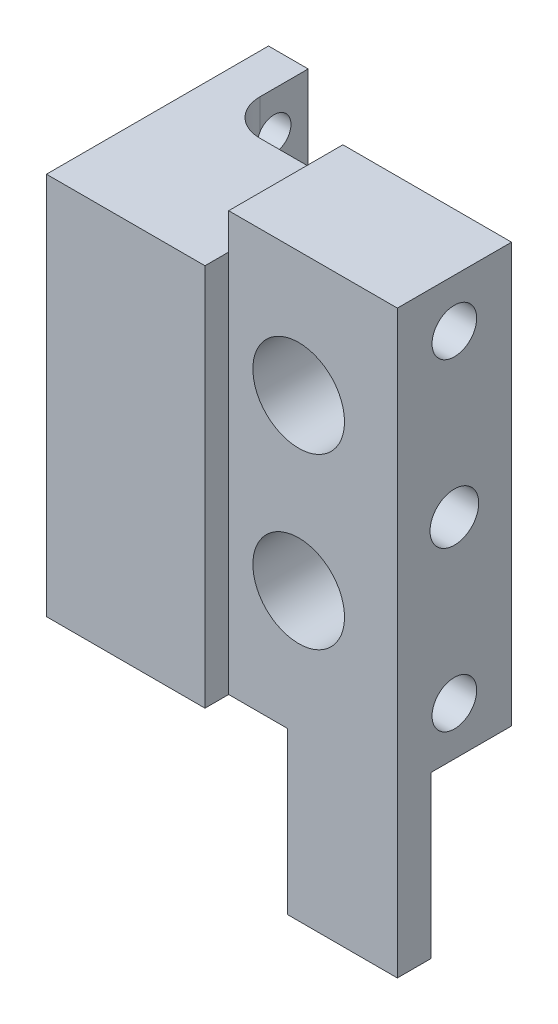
ISO-10303-21;
HEADER;
FILE_DESCRIPTION(('STEP AP214'),'2;1');
FILE_NAME('part.step','',(''),(''),'','','');
FILE_SCHEMA(('AUTOMOTIVE_DESIGN { 1 0 10303 214 1 1 1 1 }'));
ENDSEC;
DATA;
#1=APPLICATION_CONTEXT('core data for automotive mechanical design processes');
#2=APPLICATION_PROTOCOL_DEFINITION('international standard','automotive_design',2000,#1);
#3=PRODUCT_CONTEXT('',#1,'mechanical');
#4=PRODUCT('Part','Part','',(#3));
#5=PRODUCT_RELATED_PRODUCT_CATEGORY('part','',(#4));
#6=PRODUCT_DEFINITION_FORMATION('','',#4);
#7=PRODUCT_DEFINITION_CONTEXT('part definition',#1,'design');
#8=PRODUCT_DEFINITION('design','',#6,#7);
#9=PRODUCT_DEFINITION_SHAPE('','',#8);
#10=(LENGTH_UNIT() NAMED_UNIT(*) SI_UNIT(.MILLI.,.METRE.));
#11=(NAMED_UNIT(*) PLANE_ANGLE_UNIT() SI_UNIT($,.RADIAN.));
#12=(NAMED_UNIT(*) SI_UNIT($,.STERADIAN.) SOLID_ANGLE_UNIT());
#13=UNCERTAINTY_MEASURE_WITH_UNIT(LENGTH_MEASURE(1.E-05),#10,'distance_accuracy_value','');
#14=(GEOMETRIC_REPRESENTATION_CONTEXT(3) GLOBAL_UNCERTAINTY_ASSIGNED_CONTEXT((#13)) GLOBAL_UNIT_ASSIGNED_CONTEXT((#10,
#11,#12)) REPRESENTATION_CONTEXT('',''));
#15=CARTESIAN_POINT('',(0.,0.,0.));
#16=DIRECTION('',(0.,0.,1.));
#17=DIRECTION('',(1.,0.,0.));
#18=AXIS2_PLACEMENT_3D('',#15,#16,#17);
#19=CARTESIAN_POINT('',(6.9977,14.859,8.89));
#20=DIRECTION('',(-1.,0.,0.));
#21=DIRECTION('',(0.,-1.,0.));
#22=AXIS2_PLACEMENT_3D('',#19,#20,#21);
#23=PLANE('',#22);
#24=CARTESIAN_POINT('',(6.99770000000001,0.,4.05559999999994));
#25=DIRECTION('',(1.,0.,0.));
#26=DIRECTION('',(0.,0.,-1.));
#27=AXIS2_PLACEMENT_3D('',#24,#25,#26);
#28=CIRCLE('',#27,1.72719999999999);
#29=CARTESIAN_POINT('',(6.99770000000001,0.,2.32839999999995));
#30=VERTEX_POINT('',#29);
#31=EDGE_CURVE('E254',#30,#30,#28,.T.);
#32=ORIENTED_EDGE('',*,*,#31,.F.);
#33=EDGE_LOOP('',(#32));
#34=FACE_BOUND('',#33,.T.);
#35=CARTESIAN_POINT('',(6.99770000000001,-11.4299999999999,4.05559999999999));
#36=DIRECTION('',(1.,0.,0.));
#37=DIRECTION('',(0.,0.,-1.));
#38=AXIS2_PLACEMENT_3D('',#35,#36,#37);
#39=CIRCLE('',#38,1.58369);
#40=CARTESIAN_POINT('',(6.99770000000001,-11.4299999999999,2.47190999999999));
#41=VERTEX_POINT('',#40);
#42=EDGE_CURVE('E248',#41,#41,#39,.T.);
#43=ORIENTED_EDGE('',*,*,#42,.F.);
#44=EDGE_LOOP('',(#43));
#45=FACE_BOUND('',#44,.T.);
#46=CARTESIAN_POINT('',(6.9977,11.4300000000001,4.0556));
#47=DIRECTION('',(1.,0.,0.));
#48=DIRECTION('',(0.,0.,-1.));
#49=AXIS2_PLACEMENT_3D('',#46,#47,#48);
#50=CIRCLE('',#49,1.58369);
#51=CARTESIAN_POINT('',(6.9977,11.4300000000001,2.47191));
#52=VERTEX_POINT('',#51);
#53=EDGE_CURVE('E242',#52,#52,#50,.T.);
#54=ORIENTED_EDGE('',*,*,#53,.F.);
#55=EDGE_LOOP('',(#54));
#56=FACE_BOUND('',#55,.T.);
#57=DIRECTION('',(0.,0.,-1.));
#58=VECTOR('',#57,1.);
#59=CARTESIAN_POINT('',(6.9977,14.859,8.89));
#60=LINE('',#59,#58);
#61=CARTESIAN_POINT('',(6.99770000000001,14.859,8.099425));
#62=VERTEX_POINT('',#61);
#63=CARTESIAN_POINT('',(6.9977,14.859,0.));
#64=VERTEX_POINT('',#63);
#65=EDGE_CURVE('E298',#62,#64,#60,.T.);
#66=ORIENTED_EDGE('',*,*,#65,.F.);
#67=DIRECTION('',(0.,1.,0.));
#68=VECTOR('',#67,1.);
#69=CARTESIAN_POINT('',(6.9977,-14.859,8.099425));
#70=LINE('',#69,#68);
#71=CARTESIAN_POINT('',(6.9977,-26.289,8.099425));
#72=VERTEX_POINT('',#71);
#73=EDGE_CURVE('E314',#72,#62,#70,.T.);
#74=ORIENTED_EDGE('',*,*,#73,.F.);
#75=DIRECTION('',(0.,0.,-1.));
#76=VECTOR('',#75,1.);
#77=CARTESIAN_POINT('',(6.9977,-26.289,8.099425));
#78=LINE('',#77,#76);
#79=CARTESIAN_POINT('',(6.9977,-26.289,5.718175));
#80=VERTEX_POINT('',#79);
#81=EDGE_CURVE('E326',#72,#80,#78,.T.);
#82=ORIENTED_EDGE('',*,*,#81,.T.);
#83=DIRECTION('',(0.,1.,0.));
#84=VECTOR('',#83,1.);
#85=CARTESIAN_POINT('',(6.9977,-14.859,5.718175));
#86=LINE('',#85,#84);
#87=CARTESIAN_POINT('',(6.99770000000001,-14.859,5.718175));
#88=VERTEX_POINT('',#87);
#89=EDGE_CURVE('E266',#80,#88,#86,.T.);
#90=ORIENTED_EDGE('',*,*,#89,.T.);
#91=DIRECTION('',(0.,0.,-1.));
#92=VECTOR('',#91,1.);
#93=CARTESIAN_POINT('',(6.99770000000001,-14.859,8.89));
#94=LINE('',#93,#92);
#95=CARTESIAN_POINT('',(6.99770000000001,-14.859,0.));
#96=VERTEX_POINT('',#95);
#97=EDGE_CURVE('E311',#88,#96,#94,.T.);
#98=ORIENTED_EDGE('',*,*,#97,.T.);
#99=DIRECTION('',(0.,1.,0.));
#100=VECTOR('',#99,1.);
#101=CARTESIAN_POINT('',(6.9977,14.859,0.));
#102=LINE('',#101,#100);
#103=EDGE_CURVE('E286',#96,#64,#102,.T.);
#104=ORIENTED_EDGE('',*,*,#103,.T.);
#105=EDGE_LOOP('',(#66,#74,#82,#90,#98,#104));
#106=FACE_BOUND('',#105,.T.);
#107=ADVANCED_FACE('F33',(#34,#45,#56,#106),#23,.F.);
#108=CARTESIAN_POINT('',(-6.9977,14.859,8.89));
#109=DIRECTION('',(0.,-1.,0.));
#110=DIRECTION('',(0.,0.,-1.));
#111=AXIS2_PLACEMENT_3D('',#108,#109,#110);
#112=PLANE('',#111);
#113=DIRECTION('',(1.,0.,0.));
#114=VECTOR('',#113,1.);
#115=CARTESIAN_POINT('',(-4.9657,14.859,8.099425));
#116=LINE('',#115,#114);
#117=CARTESIAN_POINT('',(-4.9657,14.859,8.099425));
#118=VERTEX_POINT('',#117);
#119=EDGE_CURVE('E48',#118,#62,#116,.T.);
#120=ORIENTED_EDGE('',*,*,#119,.T.);
#121=ORIENTED_EDGE('',*,*,#65,.T.);
#122=DIRECTION('',(-1.,0.,0.));
#123=VECTOR('',#122,1.);
#124=CARTESIAN_POINT('',(-6.9977,14.859,0.));
#125=LINE('',#124,#123);
#126=CARTESIAN_POINT('',(-4.9657,14.859,0.));
#127=VERTEX_POINT('',#126);
#128=EDGE_CURVE('E295',#64,#127,#125,.T.);
#129=ORIENTED_EDGE('',*,*,#128,.T.);
#130=DIRECTION('',(0.,0.,-1.));
#131=VECTOR('',#130,1.);
#132=CARTESIAN_POINT('',(-4.9657,14.859,-5.969));
#133=LINE('',#132,#131);
#134=EDGE_CURVE('E201',#118,#127,#133,.T.);
#135=ORIENTED_EDGE('',*,*,#134,.F.);
#136=EDGE_LOOP('',(#120,#121,#129,#135));
#137=FACE_BOUND('',#136,.T.);
#138=ADVANCED_FACE('F382',(#137),#112,.F.);
#139=CARTESIAN_POINT('',(0.,-6.00000000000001,8.89));
#140=DIRECTION('',(0.,0.,1.));
#141=DIRECTION('',(1.,0.,0.));
#142=AXIS2_PLACEMENT_3D('',#139,#140,#141);
#143=CYLINDRICAL_SURFACE('',#142,3.25);
#144=CARTESIAN_POINT('',(0.,-6.00000000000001,2.89));
#145=DIRECTION('',(0.,0.,1.));
#146=DIRECTION('',(1.,0.,0.));
#147=AXIS2_PLACEMENT_3D('',#144,#145,#146);
#148=CIRCLE('',#147,3.25);
#149=CARTESIAN_POINT('',(3.25,-6.00000000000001,2.89));
#150=VERTEX_POINT('',#149);
#151=EDGE_CURVE('E357',#150,#150,#148,.T.);
#152=ORIENTED_EDGE('',*,*,#151,.F.);
#153=EDGE_LOOP('',(#152));
#154=FACE_BOUND('',#153,.T.);
#155=CARTESIAN_POINT('',(0.,-6.00000000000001,8.099425));
#156=DIRECTION('',(0.,0.,1.));
#157=DIRECTION('',(1.,0.,0.));
#158=AXIS2_PLACEMENT_3D('',#155,#156,#157);
#159=CIRCLE('',#158,3.25);
#160=CARTESIAN_POINT('',(3.25,-6.00000000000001,8.099425));
#161=VERTEX_POINT('',#160);
#162=EDGE_CURVE('E175',#161,#161,#159,.F.);
#163=ORIENTED_EDGE('',*,*,#162,.F.);
#164=EDGE_LOOP('',(#163));
#165=FACE_BOUND('',#164,.T.);
#166=ADVANCED_FACE('F388',(#154,#165),#143,.F.);
#167=CARTESIAN_POINT('',(0.,6.00000000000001,8.89));
#168=DIRECTION('',(0.,0.,1.));
#169=DIRECTION('',(1.,0.,0.));
#170=AXIS2_PLACEMENT_3D('',#167,#168,#169);
#171=CYLINDRICAL_SURFACE('',#170,3.25);
#172=CARTESIAN_POINT('',(0.,6.00000000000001,2.89));
#173=DIRECTION('',(0.,0.,1.));
#174=DIRECTION('',(1.,0.,0.));
#175=AXIS2_PLACEMENT_3D('',#172,#173,#174);
#176=CIRCLE('',#175,3.25);
#177=CARTESIAN_POINT('',(3.25,6.00000000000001,2.89));
#178=VERTEX_POINT('',#177);
#179=EDGE_CURVE('E348',#178,#178,#176,.T.);
#180=ORIENTED_EDGE('',*,*,#179,.F.);
#181=EDGE_LOOP('',(#180));
#182=FACE_BOUND('',#181,.T.);
#183=CARTESIAN_POINT('',(0.,6.00000000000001,8.099425));
#184=DIRECTION('',(0.,0.,1.));
#185=DIRECTION('',(1.,0.,0.));
#186=AXIS2_PLACEMENT_3D('',#183,#184,#185);
#187=CIRCLE('',#186,3.25);
#188=CARTESIAN_POINT('',(3.25,6.00000000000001,8.099425));
#189=VERTEX_POINT('',#188);
#190=EDGE_CURVE('E172',#189,#189,#187,.F.);
#191=ORIENTED_EDGE('',*,*,#190,.F.);
#192=EDGE_LOOP('',(#191));
#193=FACE_BOUND('',#192,.T.);
#194=ADVANCED_FACE('F408',(#182,#193),#171,.F.);
#195=CARTESIAN_POINT('',(-4.9657,-6.31495190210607,-5.969));
#196=DIRECTION('',(1.,0.,0.));
#197=DIRECTION('',(0.,0.,-1.));
#198=AXIS2_PLACEMENT_3D('',#195,#196,#197);
#199=PLANE('',#198);
#200=DIRECTION('',(0.,-1.,0.));
#201=VECTOR('',#200,1.);
#202=CARTESIAN_POINT('',(-4.9657,-6.31495190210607,8.099425));
#203=LINE('',#202,#201);
#204=CARTESIAN_POINT('',(-4.9657,12.319,8.099425));
#205=VERTEX_POINT('',#204);
#206=EDGE_CURVE('E11',#118,#205,#203,.T.);
#207=ORIENTED_EDGE('',*,*,#206,.F.);
#208=ORIENTED_EDGE('',*,*,#134,.T.);
#209=DIRECTION('',(0.,1.,0.));
#210=VECTOR('',#209,1.);
#211=CARTESIAN_POINT('',(-4.9657,-14.859,0.));
#212=LINE('',#211,#210);
#213=CARTESIAN_POINT('',(-4.9657,12.319,0.));
#214=VERTEX_POINT('',#213);
#215=EDGE_CURVE('E212',#214,#127,#212,.T.);
#216=ORIENTED_EDGE('',*,*,#215,.F.);
#217=DIRECTION('',(0.,0.,1.));
#218=VECTOR('',#217,1.);
#219=CARTESIAN_POINT('',(-4.9657,12.319,-5.969));
#220=LINE('',#219,#218);
#221=EDGE_CURVE('E202',#214,#205,#220,.T.);
#222=ORIENTED_EDGE('',*,*,#221,.T.);
#223=EDGE_LOOP('',(#207,#208,#216,#222));
#224=FACE_BOUND('',#223,.T.);
#225=ADVANCED_FACE('F402',(#224),#199,.F.);
#226=CARTESIAN_POINT('',(-16.21,0.793676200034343,4.62700000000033));
#227=DIRECTION('',(-1.,0.,0.));
#228=DIRECTION('',(0.,0.,-1.));
#229=AXIS2_PLACEMENT_3D('',#226,#227,#228);
#230=PLANE('',#229);
#231=CARTESIAN_POINT('',(-16.21,4.57199999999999,-3.55600000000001));
#232=DIRECTION('',(-1.,0.,0.));
#233=DIRECTION('',(0.,0.,1.));
#234=AXIS2_PLACEMENT_3D('',#231,#232,#233);
#235=CIRCLE('',#234,1.025);
#236=CARTESIAN_POINT('',(-16.21,4.57199999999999,-2.53100000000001));
#237=VERTEX_POINT('',#236);
#238=EDGE_CURVE('E215',#237,#237,#235,.T.);
#239=ORIENTED_EDGE('',*,*,#238,.F.);
#240=EDGE_LOOP('',(#239));
#241=FACE_BOUND('',#240,.T.);
#242=CARTESIAN_POINT('',(-16.21,4.57199999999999,7.36599999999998));
#243=DIRECTION('',(-1.,0.,0.));
#244=DIRECTION('',(0.,0.,1.));
#245=AXIS2_PLACEMENT_3D('',#242,#243,#244);
#246=CIRCLE('',#245,1.025);
#247=CARTESIAN_POINT('',(-16.21,4.57199999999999,8.39099999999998));
#248=VERTEX_POINT('',#247);
#249=EDGE_CURVE('E224',#248,#248,#246,.T.);
#250=ORIENTED_EDGE('',*,*,#249,.F.);
#251=EDGE_LOOP('',(#250));
#252=FACE_BOUND('',#251,.T.);
#253=CARTESIAN_POINT('',(-16.21,-8.25499999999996,7.3660000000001));
#254=DIRECTION('',(-1.,0.,0.));
#255=DIRECTION('',(0.,0.,1.));
#256=AXIS2_PLACEMENT_3D('',#253,#254,#255);
#257=CIRCLE('',#256,1.025);
#258=CARTESIAN_POINT('',(-16.21,-8.25499999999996,8.3910000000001));
#259=VERTEX_POINT('',#258);
#260=EDGE_CURVE('E230',#259,#259,#257,.T.);
#261=ORIENTED_EDGE('',*,*,#260,.F.);
#262=EDGE_LOOP('',(#261));
#263=FACE_BOUND('',#262,.T.);
#264=CARTESIAN_POINT('',(-16.21,-8.25499999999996,-3.5559999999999));
#265=DIRECTION('',(-1.,0.,0.));
#266=DIRECTION('',(0.,0.,1.));
#267=AXIS2_PLACEMENT_3D('',#264,#265,#266);
#268=CIRCLE('',#267,1.025);
#269=CARTESIAN_POINT('',(-16.21,-8.25499999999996,-2.5309999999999));
#270=VERTEX_POINT('',#269);
#271=EDGE_CURVE('E233',#270,#270,#268,.T.);
#272=ORIENTED_EDGE('',*,*,#271,.F.);
#273=EDGE_LOOP('',(#272));
#274=FACE_BOUND('',#273,.T.);
#275=CARTESIAN_POINT('',(-16.21,9.52500000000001,7.36599999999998));
#276=DIRECTION('',(-1.,0.,0.));
#277=DIRECTION('',(0.,0.,1.));
#278=AXIS2_PLACEMENT_3D('',#275,#276,#277);
#279=CIRCLE('',#278,1.19062499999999);
#280=CARTESIAN_POINT('',(-16.21,9.52500000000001,8.55662499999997));
#281=VERTEX_POINT('',#280);
#282=EDGE_CURVE('E198',#281,#281,#279,.T.);
#283=ORIENTED_EDGE('',*,*,#282,.F.);
#284=EDGE_LOOP('',(#283));
#285=FACE_BOUND('',#284,.T.);
#286=CARTESIAN_POINT('',(-16.21,9.52500000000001,-3.55600000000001));
#287=DIRECTION('',(-1.,0.,0.));
#288=DIRECTION('',(0.,0.,1.));
#289=AXIS2_PLACEMENT_3D('',#286,#287,#288);
#290=CIRCLE('',#289,1.19062499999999);
#291=CARTESIAN_POINT('',(-16.21,9.52500000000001,-2.36537500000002));
#292=VERTEX_POINT('',#291);
#293=EDGE_CURVE('E189',#292,#292,#290,.T.);
#294=ORIENTED_EDGE('',*,*,#293,.F.);
#295=EDGE_LOOP('',(#294));
#296=FACE_BOUND('',#295,.T.);
#297=DIRECTION('',(0.,0.,1.));
#298=VECTOR('',#297,1.);
#299=CARTESIAN_POINT('',(-16.21,-14.859,0.));
#300=LINE('',#299,#298);
#301=CARTESIAN_POINT('',(-16.2100000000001,-14.859,-5.969));
#302=VERTEX_POINT('',#301);
#303=CARTESIAN_POINT('',(-16.2100000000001,-14.859,9.77900000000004));
#304=VERTEX_POINT('',#303);
#305=EDGE_CURVE('E307',#302,#304,#300,.T.);
#306=ORIENTED_EDGE('',*,*,#305,.T.);
#307=DIRECTION('',(0.,1.,0.));
#308=VECTOR('',#307,1.);
#309=CARTESIAN_POINT('',(-16.2100000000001,12.319,9.77900000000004));
#310=LINE('',#309,#308);
#311=CARTESIAN_POINT('',(-16.2100000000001,12.319,9.77900000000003));
#312=VERTEX_POINT('',#311);
#313=EDGE_CURVE('E181',#304,#312,#310,.T.);
#314=ORIENTED_EDGE('',*,*,#313,.T.);
#315=DIRECTION('',(0.,0.,1.));
#316=VECTOR('',#315,1.);
#317=CARTESIAN_POINT('',(-16.21,12.319,13.716));
#318=LINE('',#317,#316);
#319=CARTESIAN_POINT('',(-16.2100000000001,12.319,-5.969));
#320=VERTEX_POINT('',#319);
#321=EDGE_CURVE('E159',#320,#312,#318,.T.);
#322=ORIENTED_EDGE('',*,*,#321,.F.);
#323=DIRECTION('',(0.,1.,0.));
#324=VECTOR('',#323,1.);
#325=CARTESIAN_POINT('',(-16.2100000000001,14.859,-5.969));
#326=LINE('',#325,#324);
#327=EDGE_CURVE('E339',#302,#320,#326,.T.);
#328=ORIENTED_EDGE('',*,*,#327,.F.);
#329=EDGE_LOOP('',(#306,#314,#322,#328));
#330=FACE_BOUND('',#329,.T.);
#331=ADVANCED_FACE('F395',(#241,#252,#263,#274,#285,#296,#330),#230,.T.);
#332=CARTESIAN_POINT('',(-6.9977,-14.859,8.89));
#333=DIRECTION('',(0.,1.,0.));
#334=DIRECTION('',(0.,0.,1.));
#335=AXIS2_PLACEMENT_3D('',#332,#333,#334);
#336=PLANE('',#335);
#337=DIRECTION('',(-1.,0.,0.));
#338=VECTOR('',#337,1.);
#339=CARTESIAN_POINT('',(-4.9657,-14.859,8.099425));
#340=LINE('',#339,#338);
#341=CARTESIAN_POINT('',(-0.783589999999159,-14.859,8.099425));
#342=VERTEX_POINT('',#341);
#343=CARTESIAN_POINT('',(-4.9657,-14.859,8.099425));
#344=VERTEX_POINT('',#343);
#345=EDGE_CURVE('E165',#342,#344,#340,.T.);
#346=ORIENTED_EDGE('',*,*,#345,.T.);
#347=DIRECTION('',(0.,0.,-1.));
#348=VECTOR('',#347,1.);
#349=CARTESIAN_POINT('',(-4.9657,-14.859,8.099425));
#350=LINE('',#349,#348);
#351=CARTESIAN_POINT('',(-4.9657,-14.859,9.77900000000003));
#352=VERTEX_POINT('',#351);
#353=EDGE_CURVE('E150',#352,#344,#350,.T.);
#354=ORIENTED_EDGE('',*,*,#353,.F.);
#355=DIRECTION('',(-1.,0.,0.));
#356=VECTOR('',#355,1.);
#357=CARTESIAN_POINT('',(-4.96569999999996,-14.859,9.77900000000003));
#358=LINE('',#357,#356);
#359=EDGE_CURVE('E56',#352,#304,#358,.T.);
#360=ORIENTED_EDGE('',*,*,#359,.T.);
#361=ORIENTED_EDGE('',*,*,#305,.F.);
#362=DIRECTION('',(-1.,0.,0.));
#363=VECTOR('',#362,1.);
#364=CARTESIAN_POINT('',(-16.2100000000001,-14.859,-5.969));
#365=LINE('',#364,#363);
#366=CARTESIAN_POINT('',(-13.3946899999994,-14.859,-5.969));
#367=VERTEX_POINT('',#366);
#368=EDGE_CURVE('E308',#367,#302,#365,.T.);
#369=ORIENTED_EDGE('',*,*,#368,.F.);
#370=DIRECTION('',(0.,0.,1.));
#371=VECTOR('',#370,1.);
#372=CARTESIAN_POINT('',(-13.3946899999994,-14.859,-5.969));
#373=LINE('',#372,#371);
#374=CARTESIAN_POINT('',(-13.3946899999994,-14.859,-2.54));
#375=VERTEX_POINT('',#374);
#376=EDGE_CURVE('E304',#367,#375,#373,.T.);
#377=ORIENTED_EDGE('',*,*,#376,.T.);
#378=CARTESIAN_POINT('',(-10.8546899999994,-14.859,-2.54));
#379=DIRECTION('',(0.,1.,0.));
#380=DIRECTION('',(0.,0.,1.));
#381=AXIS2_PLACEMENT_3D('',#378,#379,#380);
#382=CIRCLE('',#381,2.54);
#383=CARTESIAN_POINT('',(-10.8546899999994,-14.859,0.));
#384=VERTEX_POINT('',#383);
#385=EDGE_CURVE('E806',#375,#384,#382,.T.);
#386=ORIENTED_EDGE('',*,*,#385,.T.);
#387=DIRECTION('',(1.,0.,0.));
#388=VECTOR('',#387,1.);
#389=CARTESIAN_POINT('',(-6.99770000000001,-14.859,0.));
#390=LINE('',#389,#388);
#391=EDGE_CURVE('E283',#384,#96,#390,.T.);
#392=ORIENTED_EDGE('',*,*,#391,.T.);
#393=ORIENTED_EDGE('',*,*,#97,.F.);
#394=DIRECTION('',(-1.,0.,0.));
#395=VECTOR('',#394,1.);
#396=CARTESIAN_POINT('',(-0.78358999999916,-14.859,5.718175));
#397=LINE('',#396,#395);
#398=CARTESIAN_POINT('',(-0.78358999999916,-14.859,5.718175));
#399=VERTEX_POINT('',#398);
#400=EDGE_CURVE('E272',#88,#399,#397,.T.);
#401=ORIENTED_EDGE('',*,*,#400,.T.);
#402=DIRECTION('',(0.,0.,-1.));
#403=VECTOR('',#402,1.);
#404=CARTESIAN_POINT('',(-0.78358999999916,-14.859,8.099425));
#405=LINE('',#404,#403);
#406=EDGE_CURVE('E170',#342,#399,#405,.T.);
#407=ORIENTED_EDGE('',*,*,#406,.F.);
#408=EDGE_LOOP('',(#346,#354,#360,#361,#369,#377,#386,#392,#393,#401,#407));
#409=FACE_BOUND('',#408,.T.);
#410=ADVANCED_FACE('F168',(#409),#336,.F.);
#411=CARTESIAN_POINT('',(-6.99770000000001,12.319,8.89));
#412=DIRECTION('',(0.,1.,0.));
#413=DIRECTION('',(0.,0.,1.));
#414=AXIS2_PLACEMENT_3D('',#411,#412,#413);
#415=PLANE('',#414);
#416=ORIENTED_EDGE('',*,*,#321,.T.);
#417=DIRECTION('',(1.,0.,0.));
#418=VECTOR('',#417,1.);
#419=CARTESIAN_POINT('',(-4.96569999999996,12.319,9.77900000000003));
#420=LINE('',#419,#418);
#421=CARTESIAN_POINT('',(-4.9657,12.319,9.77900000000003));
#422=VERTEX_POINT('',#421);
#423=EDGE_CURVE('E186',#312,#422,#420,.T.);
#424=ORIENTED_EDGE('',*,*,#423,.T.);
#425=DIRECTION('',(0.,0.,1.));
#426=VECTOR('',#425,1.);
#427=CARTESIAN_POINT('',(-4.9657,12.319,8.099425));
#428=LINE('',#427,#426);
#429=EDGE_CURVE('E160',#205,#422,#428,.T.);
#430=ORIENTED_EDGE('',*,*,#429,.F.);
#431=ORIENTED_EDGE('',*,*,#221,.F.);
#432=DIRECTION('',(-1.,0.,0.));
#433=VECTOR('',#432,1.);
#434=CARTESIAN_POINT('',(-6.9977,12.319,0.));
#435=LINE('',#434,#433);
#436=CARTESIAN_POINT('',(-10.8546899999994,12.319,0.));
#437=VERTEX_POINT('',#436);
#438=EDGE_CURVE('E210',#214,#437,#435,.T.);
#439=ORIENTED_EDGE('',*,*,#438,.T.);
#440=CARTESIAN_POINT('',(-10.8546899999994,12.319,-2.54));
#441=DIRECTION('',(0.,1.,0.));
#442=DIRECTION('',(0.,0.,1.));
#443=AXIS2_PLACEMENT_3D('',#440,#441,#442);
#444=CIRCLE('',#443,2.54);
#445=CARTESIAN_POINT('',(-13.3946899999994,12.319,-2.54));
#446=VERTEX_POINT('',#445);
#447=EDGE_CURVE('E486',#437,#446,#444,.F.);
#448=ORIENTED_EDGE('',*,*,#447,.T.);
#449=DIRECTION('',(0.,0.,-1.));
#450=VECTOR('',#449,1.);
#451=CARTESIAN_POINT('',(-13.3946899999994,12.319,-5.969));
#452=LINE('',#451,#450);
#453=CARTESIAN_POINT('',(-13.3946899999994,12.319,-5.969));
#454=VERTEX_POINT('',#453);
#455=EDGE_CURVE('E207',#446,#454,#452,.T.);
#456=ORIENTED_EDGE('',*,*,#455,.T.);
#457=DIRECTION('',(1.,0.,0.));
#458=VECTOR('',#457,1.);
#459=CARTESIAN_POINT('',(-16.2100000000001,12.319,-5.969));
#460=LINE('',#459,#458);
#461=EDGE_CURVE('E204',#320,#454,#460,.T.);
#462=ORIENTED_EDGE('',*,*,#461,.F.);
#463=EDGE_LOOP('',(#416,#424,#430,#431,#439,#448,#456,#462));
#464=FACE_BOUND('',#463,.T.);
#465=ADVANCED_FACE('F394',(#464),#415,.T.);
#466=CARTESIAN_POINT('',(-4.9657,12.319,8.099425));
#467=DIRECTION('',(1.,0.,0.));
#468=DIRECTION('',(0.,0.,-1.));
#469=AXIS2_PLACEMENT_3D('',#466,#467,#468);
#470=PLANE('',#469);
#471=ORIENTED_EDGE('',*,*,#429,.T.);
#472=DIRECTION('',(0.,-1.,0.));
#473=VECTOR('',#472,1.);
#474=CARTESIAN_POINT('',(-4.9657,12.319,9.77900000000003));
#475=LINE('',#474,#473);
#476=EDGE_CURVE('E156',#422,#352,#475,.T.);
#477=ORIENTED_EDGE('',*,*,#476,.T.);
#478=ORIENTED_EDGE('',*,*,#353,.T.);
#479=DIRECTION('',(0.,1.,0.));
#480=VECTOR('',#479,1.);
#481=CARTESIAN_POINT('',(-4.9657,14.859,8.099425));
#482=LINE('',#481,#480);
#483=EDGE_CURVE('E154',#344,#205,#482,.T.);
#484=ORIENTED_EDGE('',*,*,#483,.T.);
#485=EDGE_LOOP('',(#471,#477,#478,#484));
#486=FACE_BOUND('',#485,.T.);
#487=ADVANCED_FACE('F153',(#486),#470,.T.);
#488=CARTESIAN_POINT('',(-13.3946899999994,14.859,-5.969));
#489=DIRECTION('',(-1.,0.,0.));
#490=DIRECTION('',(0.,-1.,0.));
#491=AXIS2_PLACEMENT_3D('',#488,#489,#490);
#492=PLANE('',#491);
#493=DIRECTION('',(0.,-1.,0.));
#494=VECTOR('',#493,1.);
#495=CARTESIAN_POINT('',(-13.3946899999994,-14.859,-2.54));
#496=LINE('',#495,#494);
#497=CARTESIAN_POINT('',(-13.3946899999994,10.1457510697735,-2.54));
#498=VERTEX_POINT('',#497);
#499=EDGE_CURVE('E277',#446,#498,#496,.T.);
#500=ORIENTED_EDGE('',*,*,#499,.T.);
#501=CARTESIAN_POINT('',(-13.3946899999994,9.52500000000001,-3.55600000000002));
#502=DIRECTION('',(-1.,0.,0.));
#503=DIRECTION('',(0.,-1.,0.));
#504=AXIS2_PLACEMENT_3D('',#501,#502,#503);
#505=CIRCLE('',#504,1.19062499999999);
#506=CARTESIAN_POINT('',(-13.3946899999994,8.90424893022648,-2.54));
#507=VERTEX_POINT('',#506);
#508=EDGE_CURVE('E192',#498,#507,#505,.T.);
#509=ORIENTED_EDGE('',*,*,#508,.T.);
#510=CARTESIAN_POINT('',(-13.3946899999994,4.7075322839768,-2.54));
#511=VERTEX_POINT('',#510);
#512=EDGE_CURVE('E281',#507,#511,#496,.T.);
#513=ORIENTED_EDGE('',*,*,#512,.T.);
#514=CARTESIAN_POINT('',(-13.3946899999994,4.57199999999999,-3.55600000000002));
#515=DIRECTION('',(-1.,0.,0.));
#516=DIRECTION('',(0.,-1.,0.));
#517=AXIS2_PLACEMENT_3D('',#514,#515,#516);
#518=CIRCLE('',#517,1.025);
#519=CARTESIAN_POINT('',(-13.3946899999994,4.43646771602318,-2.54));
#520=VERTEX_POINT('',#519);
#521=EDGE_CURVE('E218',#511,#520,#518,.T.);
#522=ORIENTED_EDGE('',*,*,#521,.T.);
#523=CARTESIAN_POINT('',(-13.3946899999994,-8.11946771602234,-2.54));
#524=VERTEX_POINT('',#523);
#525=EDGE_CURVE('E802',#520,#524,#496,.T.);
#526=ORIENTED_EDGE('',*,*,#525,.T.);
#527=CARTESIAN_POINT('',(-13.3946899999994,-8.25499999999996,-3.55599999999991));
#528=DIRECTION('',(-1.,0.,0.));
#529=DIRECTION('',(0.,-1.,0.));
#530=AXIS2_PLACEMENT_3D('',#527,#528,#529);
#531=CIRCLE('',#530,1.025);
#532=CARTESIAN_POINT('',(-13.3946899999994,-8.39053228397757,-2.54));
#533=VERTEX_POINT('',#532);
#534=EDGE_CURVE('E236',#524,#533,#531,.T.);
#535=ORIENTED_EDGE('',*,*,#534,.T.);
#536=EDGE_CURVE('E282',#533,#375,#496,.T.);
#537=ORIENTED_EDGE('',*,*,#536,.T.);
#538=ORIENTED_EDGE('',*,*,#376,.F.);
#539=DIRECTION('',(0.,-1.,0.));
#540=VECTOR('',#539,1.);
#541=CARTESIAN_POINT('',(-13.3946899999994,14.859,-5.969));
#542=LINE('',#541,#540);
#543=EDGE_CURVE('E342',#454,#367,#542,.T.);
#544=ORIENTED_EDGE('',*,*,#543,.F.);
#545=ORIENTED_EDGE('',*,*,#455,.F.);
#546=EDGE_LOOP('',(#500,#509,#513,#522,#526,#535,#537,#538,#544,#545));
#547=FACE_BOUND('',#546,.T.);
#548=ADVANCED_FACE('F415',(#547),#492,.F.);
#549=CARTESIAN_POINT('',(-16.2100000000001,-14.859,-5.969));
#550=DIRECTION('',(0.,0.,1.));
#551=DIRECTION('',(1.,0.,0.));
#552=AXIS2_PLACEMENT_3D('',#549,#550,#551);
#553=PLANE('',#552);
#554=ORIENTED_EDGE('',*,*,#461,.T.);
#555=ORIENTED_EDGE('',*,*,#543,.T.);
#556=ORIENTED_EDGE('',*,*,#368,.T.);
#557=ORIENTED_EDGE('',*,*,#327,.T.);
#558=EDGE_LOOP('',(#554,#555,#556,#557));
#559=FACE_BOUND('',#558,.T.);
#560=ADVANCED_FACE('F448',(#559),#553,.F.);
#561=CARTESIAN_POINT('',(-10.8546899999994,14.859,-2.54));
#562=DIRECTION('',(0.,1.,0.));
#563=DIRECTION('',(-1.,0.,0.));
#564=AXIS2_PLACEMENT_3D('',#561,#562,#563);
#565=CYLINDRICAL_SURFACE('',#564,2.54);
#566=ORIENTED_EDGE('',*,*,#512,.F.);
#567=CARTESIAN_POINT('',(-13.3946899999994,8.90424893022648,-2.54));
#568=CARTESIAN_POINT('',(-13.3946881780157,8.93282424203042,-2.5225414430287));
#569=CARTESIAN_POINT('',(-13.3945103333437,8.96212169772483,-2.50629771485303));
#570=CARTESIAN_POINT('',(-13.3939364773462,9.02197600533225,-2.47633527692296));
#571=CARTESIAN_POINT('',(-13.3935404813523,9.05253276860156,-2.46261638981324));
#572=CARTESIAN_POINT('',(-13.3922276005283,9.14570765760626,-2.42543177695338));
#573=CARTESIAN_POINT('',(-13.3911848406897,9.20993579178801,-2.40587384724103));
#574=CARTESIAN_POINT('',(-13.3895458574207,9.34076008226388,-2.37781196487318));
#575=CARTESIAN_POINT('',(-13.3889497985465,9.40735710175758,-2.36931208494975));
#576=CARTESIAN_POINT('',(-13.3885594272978,9.54106149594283,-2.36360557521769));
#577=CARTESIAN_POINT('',(-13.3887652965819,9.60816898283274,-2.36640150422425));
#578=CARTESIAN_POINT('',(-13.3898591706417,9.74090243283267,-2.38320398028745));
#579=CARTESIAN_POINT('',(-13.3907467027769,9.80652939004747,-2.39720275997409));
#580=CARTESIAN_POINT('',(-13.3926345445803,9.93442073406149,-2.43599502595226));
#581=CARTESIAN_POINT('',(-13.3936346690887,9.99669039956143,-2.46077097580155));
#582=CARTESIAN_POINT('',(-13.3945014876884,10.0868975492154,-2.50574715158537));
#583=CARTESIAN_POINT('',(-13.3946833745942,10.1167169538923,-2.52224823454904));
#584=CARTESIAN_POINT('',(-13.3946899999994,10.1457510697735,-2.54));
#585=B_SPLINE_CURVE_WITH_KNOTS('',3,(#567,#568,#569,#570,#571,#572,#573,#574,#575,#576,#577,
#578,#579,#580,#581,#582,#583,#584),.UNSPECIFIED.,.F.,.F.,(4,2,2,2,2,2,2,2,4),(0.,
0.100396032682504,0.200785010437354,0.401197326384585,0.60168343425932,0.802214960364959,
1.00260757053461,1.20267531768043,1.30478562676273),.UNSPECIFIED.);
#586=EDGE_CURVE('E42',#507,#498,#585,.T.);
#587=ORIENTED_EDGE('',*,*,#586,.T.);
#588=ORIENTED_EDGE('',*,*,#499,.F.);
#589=ORIENTED_EDGE('',*,*,#447,.F.);
#590=DIRECTION('',(0.,-1.,0.));
#591=VECTOR('',#590,1.);
#592=CARTESIAN_POINT('',(-10.8546899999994,14.859,0.));
#593=LINE('',#592,#591);
#594=EDGE_CURVE('E280',#384,#437,#593,.F.);
#595=ORIENTED_EDGE('',*,*,#594,.F.);
#596=ORIENTED_EDGE('',*,*,#385,.F.);
#597=ORIENTED_EDGE('',*,*,#536,.F.);
#598=CARTESIAN_POINT('',(-13.3946899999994,-8.39053228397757,-2.54));
#599=CARTESIAN_POINT('',(-13.3946793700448,-8.34535485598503,-2.53399999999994));
#600=CARTESIAN_POINT('',(-13.3946740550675,-8.30017742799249,-2.5309999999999));
#601=CARTESIAN_POINT('',(-13.3946740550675,-8.20982257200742,-2.5309999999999));
#602=CARTESIAN_POINT('',(-13.3946793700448,-8.16464514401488,-2.53399999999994));
#603=CARTESIAN_POINT('',(-13.3946899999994,-8.11946771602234,-2.54));
#604=B_SPLINE_CURVE_WITH_KNOTS('',3,(#598,#599,#600,#601,#602,#603),.UNSPECIFIED.,.F.,.F.,(4,2,
4),(0.,0.135830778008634,0.271661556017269),.UNSPECIFIED.);
#605=EDGE_CURVE('E495',#533,#524,#604,.T.);
#606=ORIENTED_EDGE('',*,*,#605,.T.);
#607=ORIENTED_EDGE('',*,*,#525,.F.);
#608=CARTESIAN_POINT('',(-13.3946899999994,4.43646771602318,-2.54));
#609=CARTESIAN_POINT('',(-13.3946793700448,4.48164514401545,-2.53400000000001));
#610=CARTESIAN_POINT('',(-13.3946740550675,4.52682257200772,-2.53100000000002));
#611=CARTESIAN_POINT('',(-13.3946740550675,4.61717742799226,-2.53100000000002));
#612=CARTESIAN_POINT('',(-13.3946793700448,4.66235485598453,-2.53400000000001));
#613=CARTESIAN_POINT('',(-13.3946899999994,4.7075322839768,-2.54));
#614=B_SPLINE_CURVE_WITH_KNOTS('',3,(#608,#609,#610,#611,#612,#613),.UNSPECIFIED.,.F.,.F.,(4,2,
4),(0.,0.135830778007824,0.271661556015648),.UNSPECIFIED.);
#615=EDGE_CURVE('E488',#520,#511,#614,.T.);
#616=ORIENTED_EDGE('',*,*,#615,.T.);
#617=EDGE_LOOP('',(#566,#587,#588,#589,#595,#596,#597,#606,#607,#616));
#618=FACE_BOUND('',#617,.T.);
#619=ADVANCED_FACE('F35',(#618),#565,.F.);
#620=CARTESIAN_POINT('',(-6.99770000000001,-14.859,0.));
#621=DIRECTION('',(0.,0.,1.));
#622=DIRECTION('',(1.,0.,0.));
#623=AXIS2_PLACEMENT_3D('',#620,#621,#622);
#624=PLANE('',#623);
#625=CARTESIAN_POINT('',(0.,-6.00000000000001,0.));
#626=DIRECTION('',(0.,0.,1.));
#627=DIRECTION('',(1.,0.,0.));
#628=AXIS2_PLACEMENT_3D('',#625,#626,#627);
#629=CIRCLE('',#628,1.7);
#630=CARTESIAN_POINT('',(1.7,-6.00000000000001,0.));
#631=VERTEX_POINT('',#630);
#632=EDGE_CURVE('E287',#631,#631,#629,.T.);
#633=ORIENTED_EDGE('',*,*,#632,.T.);
#634=EDGE_LOOP('',(#633));
#635=FACE_BOUND('',#634,.T.);
#636=CARTESIAN_POINT('',(0.,6.00000000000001,0.));
#637=DIRECTION('',(0.,0.,1.));
#638=DIRECTION('',(1.,0.,0.));
#639=AXIS2_PLACEMENT_3D('',#636,#637,#638);
#640=CIRCLE('',#639,1.7);
#641=CARTESIAN_POINT('',(1.7,6.00000000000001,0.));
#642=VERTEX_POINT('',#641);
#643=EDGE_CURVE('E354',#642,#642,#640,.T.);
#644=ORIENTED_EDGE('',*,*,#643,.T.);
#645=EDGE_LOOP('',(#644));
#646=FACE_BOUND('',#645,.T.);
#647=ORIENTED_EDGE('',*,*,#438,.F.);
#648=ORIENTED_EDGE('',*,*,#215,.T.);
#649=ORIENTED_EDGE('',*,*,#128,.F.);
#650=ORIENTED_EDGE('',*,*,#103,.F.);
#651=ORIENTED_EDGE('',*,*,#391,.F.);
#652=ORIENTED_EDGE('',*,*,#594,.T.);
#653=EDGE_LOOP('',(#647,#648,#649,#650,#651,#652));
#654=FACE_BOUND('',#653,.T.);
#655=ADVANCED_FACE('F366',(#635,#646,#654),#624,.F.);
#656=CARTESIAN_POINT('',(0.,-6.00000000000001,8.89));
#657=DIRECTION('',(0.,0.,1.));
#658=DIRECTION('',(1.,0.,0.));
#659=AXIS2_PLACEMENT_3D('',#656,#657,#658);
#660=CYLINDRICAL_SURFACE('',#659,1.7);
#661=ORIENTED_EDGE('',*,*,#632,.F.);
#662=EDGE_LOOP('',(#661));
#663=FACE_BOUND('',#662,.T.);
#664=CARTESIAN_POINT('',(0.,-6.00000000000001,2.89));
#665=DIRECTION('',(0.,0.,1.));
#666=DIRECTION('',(1.,0.,0.));
#667=AXIS2_PLACEMENT_3D('',#664,#665,#666);
#668=CIRCLE('',#667,1.7);
#669=CARTESIAN_POINT('',(1.7,-6.00000000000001,2.89));
#670=VERTEX_POINT('',#669);
#671=EDGE_CURVE('E359',#670,#670,#668,.T.);
#672=ORIENTED_EDGE('',*,*,#671,.T.);
#673=EDGE_LOOP('',(#672));
#674=FACE_BOUND('',#673,.T.);
#675=ADVANCED_FACE('F369',(#663,#674),#660,.F.);
#676=CARTESIAN_POINT('',(1.7,-6.00000000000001,2.89));
#677=DIRECTION('',(0.,0.,-1.));
#678=DIRECTION('',(-1.,0.,0.));
#679=AXIS2_PLACEMENT_3D('',#676,#677,#678);
#680=PLANE('',#679);
#681=ORIENTED_EDGE('',*,*,#671,.F.);
#682=EDGE_LOOP('',(#681));
#683=FACE_BOUND('',#682,.T.);
#684=ORIENTED_EDGE('',*,*,#151,.T.);
#685=EDGE_LOOP('',(#684));
#686=FACE_BOUND('',#685,.T.);
#687=ADVANCED_FACE('F371',(#683,#686),#680,.F.);
#688=CARTESIAN_POINT('',(0.,6.00000000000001,8.89));
#689=DIRECTION('',(0.,0.,1.));
#690=DIRECTION('',(1.,0.,0.));
#691=AXIS2_PLACEMENT_3D('',#688,#689,#690);
#692=CYLINDRICAL_SURFACE('',#691,1.7);
#693=ORIENTED_EDGE('',*,*,#643,.F.);
#694=EDGE_LOOP('',(#693));
#695=FACE_BOUND('',#694,.T.);
#696=CARTESIAN_POINT('',(0.,6.00000000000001,2.89));
#697=DIRECTION('',(0.,0.,1.));
#698=DIRECTION('',(1.,0.,0.));
#699=AXIS2_PLACEMENT_3D('',#696,#697,#698);
#700=CIRCLE('',#699,1.7);
#701=CARTESIAN_POINT('',(1.7,6.00000000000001,2.89));
#702=VERTEX_POINT('',#701);
#703=EDGE_CURVE('E351',#702,#702,#700,.T.);
#704=ORIENTED_EDGE('',*,*,#703,.T.);
#705=EDGE_LOOP('',(#704));
#706=FACE_BOUND('',#705,.T.);
#707=ADVANCED_FACE('F377',(#695,#706),#692,.F.);
#708=CARTESIAN_POINT('',(1.7,6.00000000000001,2.89));
#709=DIRECTION('',(0.,0.,-1.));
#710=DIRECTION('',(-1.,0.,0.));
#711=AXIS2_PLACEMENT_3D('',#708,#709,#710);
#712=PLANE('',#711);
#713=ORIENTED_EDGE('',*,*,#703,.F.);
#714=EDGE_LOOP('',(#713));
#715=FACE_BOUND('',#714,.T.);
#716=ORIENTED_EDGE('',*,*,#179,.T.);
#717=EDGE_LOOP('',(#716));
#718=FACE_BOUND('',#717,.T.);
#719=ADVANCED_FACE('F420',(#715,#718),#712,.F.);
#720=CARTESIAN_POINT('',(-0.78358999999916,-14.859,8.099425));
#721=DIRECTION('',(1.,0.,0.));
#722=DIRECTION('',(0.,1.,0.));
#723=AXIS2_PLACEMENT_3D('',#720,#721,#722);
#724=PLANE('',#723);
#725=ORIENTED_EDGE('',*,*,#406,.T.);
#726=DIRECTION('',(0.,-1.,0.));
#727=VECTOR('',#726,1.);
#728=CARTESIAN_POINT('',(-0.78358999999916,-14.859,5.718175));
#729=LINE('',#728,#727);
#730=CARTESIAN_POINT('',(-0.783589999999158,-26.289,5.718175));
#731=VERTEX_POINT('',#730);
#732=EDGE_CURVE('E260',#399,#731,#729,.T.);
#733=ORIENTED_EDGE('',*,*,#732,.T.);
#734=DIRECTION('',(0.,0.,-1.));
#735=VECTOR('',#734,1.);
#736=CARTESIAN_POINT('',(-0.783589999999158,-26.289,8.099425));
#737=LINE('',#736,#735);
#738=CARTESIAN_POINT('',(-0.783589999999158,-26.289,8.099425));
#739=VERTEX_POINT('',#738);
#740=EDGE_CURVE('E335',#739,#731,#737,.T.);
#741=ORIENTED_EDGE('',*,*,#740,.F.);
#742=DIRECTION('',(0.,-1.,0.));
#743=VECTOR('',#742,1.);
#744=CARTESIAN_POINT('',(-0.78358999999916,-14.859,8.099425));
#745=LINE('',#744,#743);
#746=EDGE_CURVE('E269',#342,#739,#745,.T.);
#747=ORIENTED_EDGE('',*,*,#746,.F.);
#748=EDGE_LOOP('',(#725,#733,#741,#747));
#749=FACE_BOUND('',#748,.T.);
#750=ADVANCED_FACE('F332',(#749),#724,.F.);
#751=CARTESIAN_POINT('',(-0.783589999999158,-26.289,8.099425));
#752=DIRECTION('',(0.,1.,0.));
#753=DIRECTION('',(0.,0.,1.));
#754=AXIS2_PLACEMENT_3D('',#751,#752,#753);
#755=PLANE('',#754);
#756=ORIENTED_EDGE('',*,*,#740,.T.);
#757=DIRECTION('',(1.,0.,0.));
#758=VECTOR('',#757,1.);
#759=CARTESIAN_POINT('',(-0.783589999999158,-26.289,5.718175));
#760=LINE('',#759,#758);
#761=EDGE_CURVE('E263',#731,#80,#760,.T.);
#762=ORIENTED_EDGE('',*,*,#761,.T.);
#763=ORIENTED_EDGE('',*,*,#81,.F.);
#764=DIRECTION('',(1.,0.,0.));
#765=VECTOR('',#764,1.);
#766=CARTESIAN_POINT('',(-0.783589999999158,-26.289,8.099425));
#767=LINE('',#766,#765);
#768=EDGE_CURVE('E316',#739,#72,#767,.T.);
#769=ORIENTED_EDGE('',*,*,#768,.F.);
#770=EDGE_LOOP('',(#756,#762,#763,#769));
#771=FACE_BOUND('',#770,.T.);
#772=ADVANCED_FACE('F436',(#771),#755,.F.);
#773=CARTESIAN_POINT('',(-0.783589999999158,-26.289,8.099425));
#774=DIRECTION('',(0.,0.,1.));
#775=DIRECTION('',(1.,0.,0.));
#776=AXIS2_PLACEMENT_3D('',#773,#774,#775);
#777=PLANE('',#776);
#778=ORIENTED_EDGE('',*,*,#746,.T.);
#779=ORIENTED_EDGE('',*,*,#768,.T.);
#780=ORIENTED_EDGE('',*,*,#73,.T.);
#781=ORIENTED_EDGE('',*,*,#119,.F.);
#782=ORIENTED_EDGE('',*,*,#206,.T.);
#783=ORIENTED_EDGE('',*,*,#483,.F.);
#784=ORIENTED_EDGE('',*,*,#345,.F.);
#785=EDGE_LOOP('',(#778,#779,#780,#781,#782,#783,#784));
#786=FACE_BOUND('',#785,.T.);
#787=ORIENTED_EDGE('',*,*,#190,.T.);
#788=EDGE_LOOP('',(#787));
#789=FACE_BOUND('',#788,.T.);
#790=ORIENTED_EDGE('',*,*,#162,.T.);
#791=EDGE_LOOP('',(#790));
#792=FACE_BOUND('',#791,.T.);
#793=ADVANCED_FACE('F163',(#786,#789,#792),#777,.T.);
#794=CARTESIAN_POINT('',(-0.783589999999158,-26.289,5.718175));
#795=DIRECTION('',(0.,0.,1.));
#796=DIRECTION('',(1.,0.,0.));
#797=AXIS2_PLACEMENT_3D('',#794,#795,#796);
#798=PLANE('',#797);
#799=ORIENTED_EDGE('',*,*,#732,.F.);
#800=ORIENTED_EDGE('',*,*,#400,.F.);
#801=ORIENTED_EDGE('',*,*,#89,.F.);
#802=ORIENTED_EDGE('',*,*,#761,.F.);
#803=EDGE_LOOP('',(#799,#800,#801,#802));
#804=FACE_BOUND('',#803,.T.);
#805=ADVANCED_FACE('F330',(#804),#798,.F.);
#806=CARTESIAN_POINT('',(6.99770000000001,0.,4.05559999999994));
#807=DIRECTION('',(1.,0.,0.));
#808=DIRECTION('',(0.,0.,-1.));
#809=AXIS2_PLACEMENT_3D('',#806,#807,#808);
#810=CYLINDRICAL_SURFACE('',#809,1.72719999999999);
#811=CARTESIAN_POINT('',(-10.61974,0.,4.05559999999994));
#812=DIRECTION('',(1.,0.,0.));
#813=DIRECTION('',(0.,0.,-1.));
#814=AXIS2_PLACEMENT_3D('',#811,#812,#813);
#815=CIRCLE('',#814,1.7272);
#816=CARTESIAN_POINT('',(-10.61974,0.,2.32839999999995));
#817=VERTEX_POINT('',#816);
#818=EDGE_CURVE('E251',#817,#817,#815,.T.);
#819=ORIENTED_EDGE('',*,*,#818,.F.);
#820=EDGE_LOOP('',(#819));
#821=FACE_BOUND('',#820,.T.);
#822=ORIENTED_EDGE('',*,*,#31,.T.);
#823=EDGE_LOOP('',(#822));
#824=FACE_BOUND('',#823,.T.);
#825=ADVANCED_FACE('F442',(#821,#824),#810,.F.);
#826=CARTESIAN_POINT('',(-10.61974,0.,4.05559999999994));
#827=DIRECTION('',(-1.,0.,0.));
#828=DIRECTION('',(0.,0.,1.));
#829=AXIS2_PLACEMENT_3D('',#826,#827,#828);
#830=PLANE('',#829);
#831=ORIENTED_EDGE('',*,*,#818,.T.);
#832=EDGE_LOOP('',(#831));
#833=FACE_BOUND('',#832,.T.);
#834=ADVANCED_FACE('F541',(#833),#830,.F.);
#835=CARTESIAN_POINT('',(6.99770000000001,-11.4299999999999,4.05559999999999));
#836=DIRECTION('',(1.,0.,0.));
#837=DIRECTION('',(0.,0.,-1.));
#838=AXIS2_PLACEMENT_3D('',#835,#836,#837);
#839=CYLINDRICAL_SURFACE('',#838,1.58369);
#840=CARTESIAN_POINT('',(0.901700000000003,-11.4299999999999,4.0556));
#841=DIRECTION('',(1.,0.,0.));
#842=DIRECTION('',(0.,0.,-1.));
#843=AXIS2_PLACEMENT_3D('',#840,#841,#842);
#844=CIRCLE('',#843,1.58369);
#845=CARTESIAN_POINT('',(0.901700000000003,-11.4299999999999,2.47191));
#846=VERTEX_POINT('',#845);
#847=EDGE_CURVE('E245',#846,#846,#844,.T.);
#848=ORIENTED_EDGE('',*,*,#847,.F.);
#849=EDGE_LOOP('',(#848));
#850=FACE_BOUND('',#849,.T.);
#851=ORIENTED_EDGE('',*,*,#42,.T.);
#852=EDGE_LOOP('',(#851));
#853=FACE_BOUND('',#852,.T.);
#854=ADVANCED_FACE('F537',(#850,#853),#839,.F.);
#855=CARTESIAN_POINT('',(0.901700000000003,-11.4299999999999,4.0556));
#856=DIRECTION('',(-1.,0.,0.));
#857=DIRECTION('',(0.,0.,1.));
#858=AXIS2_PLACEMENT_3D('',#855,#856,#857);
#859=PLANE('',#858);
#860=ORIENTED_EDGE('',*,*,#847,.T.);
#861=EDGE_LOOP('',(#860));
#862=FACE_BOUND('',#861,.T.);
#863=ADVANCED_FACE('F533',(#862),#859,.F.);
#864=CARTESIAN_POINT('',(6.9977,11.4300000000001,4.0556));
#865=DIRECTION('',(1.,0.,0.));
#866=DIRECTION('',(0.,0.,-1.));
#867=AXIS2_PLACEMENT_3D('',#864,#865,#866);
#868=CYLINDRICAL_SURFACE('',#867,1.58369);
#869=CARTESIAN_POINT('',(0.901700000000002,11.4300000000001,4.05560000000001));
#870=DIRECTION('',(1.,0.,0.));
#871=DIRECTION('',(0.,0.,-1.));
#872=AXIS2_PLACEMENT_3D('',#869,#870,#871);
#873=CIRCLE('',#872,1.58369);
#874=CARTESIAN_POINT('',(0.901700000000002,11.4300000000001,2.47191000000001));
#875=VERTEX_POINT('',#874);
#876=EDGE_CURVE('E239',#875,#875,#873,.T.);
#877=ORIENTED_EDGE('',*,*,#876,.F.);
#878=EDGE_LOOP('',(#877));
#879=FACE_BOUND('',#878,.T.);
#880=ORIENTED_EDGE('',*,*,#53,.T.);
#881=EDGE_LOOP('',(#880));
#882=FACE_BOUND('',#881,.T.);
#883=ADVANCED_FACE('F529',(#879,#882),#868,.F.);
#884=CARTESIAN_POINT('',(0.901700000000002,11.43,4.05560000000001));
#885=DIRECTION('',(-1.,0.,0.));
#886=DIRECTION('',(0.,0.,1.));
#887=AXIS2_PLACEMENT_3D('',#884,#885,#886);
#888=PLANE('',#887);
#889=ORIENTED_EDGE('',*,*,#876,.T.);
#890=EDGE_LOOP('',(#889));
#891=FACE_BOUND('',#890,.T.);
#892=ADVANCED_FACE('F525',(#891),#888,.F.);
#893=CARTESIAN_POINT('',(-16.21,-8.25499999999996,-3.5559999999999));
#894=DIRECTION('',(-1.,0.,0.));
#895=DIRECTION('',(0.,0.,1.));
#896=AXIS2_PLACEMENT_3D('',#893,#894,#895);
#897=CYLINDRICAL_SURFACE('',#896,1.025);
#898=ORIENTED_EDGE('',*,*,#271,.T.);
#899=EDGE_LOOP('',(#898));
#900=FACE_BOUND('',#899,.T.);
#901=ORIENTED_EDGE('',*,*,#605,.F.);
#902=ORIENTED_EDGE('',*,*,#534,.F.);
#903=EDGE_LOOP('',(#901,#902));
#904=FACE_BOUND('',#903,.T.);
#905=ADVANCED_FACE('F520',(#900,#904),#897,.F.);
#906=CARTESIAN_POINT('',(-16.21,-8.25499999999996,7.3660000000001));
#907=DIRECTION('',(-1.,0.,0.));
#908=DIRECTION('',(0.,0.,1.));
#909=AXIS2_PLACEMENT_3D('',#906,#907,#908);
#910=CYLINDRICAL_SURFACE('',#909,1.025);
#911=CARTESIAN_POINT('',(-7.24380000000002,-8.25499999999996,7.36600000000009));
#912=DIRECTION('',(-1.,0.,0.));
#913=DIRECTION('',(0.,0.,1.));
#914=AXIS2_PLACEMENT_3D('',#911,#912,#913);
#915=CIRCLE('',#914,1.025);
#916=CARTESIAN_POINT('',(-7.24380000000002,-8.25499999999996,8.39100000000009));
#917=VERTEX_POINT('',#916);
#918=EDGE_CURVE('E227',#917,#917,#915,.T.);
#919=ORIENTED_EDGE('',*,*,#918,.F.);
#920=EDGE_LOOP('',(#919));
#921=FACE_BOUND('',#920,.T.);
#922=ORIENTED_EDGE('',*,*,#260,.T.);
#923=EDGE_LOOP('',(#922));
#924=FACE_BOUND('',#923,.T.);
#925=ADVANCED_FACE('F517',(#921,#924),#910,.F.);
#926=CARTESIAN_POINT('',(-7.24380000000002,-8.25499999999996,7.36600000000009));
#927=DIRECTION('',(1.,0.,0.));
#928=DIRECTION('',(0.,0.,-1.));
#929=AXIS2_PLACEMENT_3D('',#926,#927,#928);
#930=PLANE('',#929);
#931=ORIENTED_EDGE('',*,*,#918,.T.);
#932=EDGE_LOOP('',(#931));
#933=FACE_BOUND('',#932,.T.);
#934=ADVANCED_FACE('F513',(#933),#930,.F.);
#935=CARTESIAN_POINT('',(-16.21,4.57199999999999,7.36599999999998));
#936=DIRECTION('',(-1.,0.,0.));
#937=DIRECTION('',(0.,0.,1.));
#938=AXIS2_PLACEMENT_3D('',#935,#936,#937);
#939=CYLINDRICAL_SURFACE('',#938,1.025);
#940=CARTESIAN_POINT('',(-7.24380000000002,4.57199999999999,7.36599999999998));
#941=DIRECTION('',(-1.,0.,0.));
#942=DIRECTION('',(0.,0.,1.));
#943=AXIS2_PLACEMENT_3D('',#940,#941,#942);
#944=CIRCLE('',#943,1.025);
#945=CARTESIAN_POINT('',(-7.24380000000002,4.57199999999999,8.39099999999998));
#946=VERTEX_POINT('',#945);
#947=EDGE_CURVE('E221',#946,#946,#944,.T.);
#948=ORIENTED_EDGE('',*,*,#947,.F.);
#949=EDGE_LOOP('',(#948));
#950=FACE_BOUND('',#949,.T.);
#951=ORIENTED_EDGE('',*,*,#249,.T.);
#952=EDGE_LOOP('',(#951));
#953=FACE_BOUND('',#952,.T.);
#954=ADVANCED_FACE('F509',(#950,#953),#939,.F.);
#955=CARTESIAN_POINT('',(-7.24380000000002,4.57199999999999,7.36599999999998));
#956=DIRECTION('',(1.,0.,0.));
#957=DIRECTION('',(0.,0.,-1.));
#958=AXIS2_PLACEMENT_3D('',#955,#956,#957);
#959=PLANE('',#958);
#960=ORIENTED_EDGE('',*,*,#947,.T.);
#961=EDGE_LOOP('',(#960));
#962=FACE_BOUND('',#961,.T.);
#963=ADVANCED_FACE('F505',(#962),#959,.F.);
#964=CARTESIAN_POINT('',(-16.21,4.57199999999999,-3.55600000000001));
#965=DIRECTION('',(-1.,0.,0.));
#966=DIRECTION('',(0.,0.,1.));
#967=AXIS2_PLACEMENT_3D('',#964,#965,#966);
#968=CYLINDRICAL_SURFACE('',#967,1.025);
#969=ORIENTED_EDGE('',*,*,#238,.T.);
#970=EDGE_LOOP('',(#969));
#971=FACE_BOUND('',#970,.T.);
#972=ORIENTED_EDGE('',*,*,#615,.F.);
#973=ORIENTED_EDGE('',*,*,#521,.F.);
#974=EDGE_LOOP('',(#972,#973));
#975=FACE_BOUND('',#974,.T.);
#976=ADVANCED_FACE('F500',(#971,#975),#968,.F.);
#977=CARTESIAN_POINT('',(-16.21,9.52500000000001,7.36599999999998));
#978=DIRECTION('',(-1.,0.,0.));
#979=DIRECTION('',(0.,0.,1.));
#980=AXIS2_PLACEMENT_3D('',#977,#978,#979);
#981=CYLINDRICAL_SURFACE('',#980,1.19062499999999);
#982=CARTESIAN_POINT('',(-11.13,9.52500000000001,7.36599999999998));
#983=DIRECTION('',(-1.,0.,0.));
#984=DIRECTION('',(0.,0.,1.));
#985=AXIS2_PLACEMENT_3D('',#982,#983,#984);
#986=CIRCLE('',#985,1.190625);
#987=CARTESIAN_POINT('',(-11.13,9.52500000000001,8.55662499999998));
#988=VERTEX_POINT('',#987);
#989=EDGE_CURVE('E195',#988,#988,#986,.T.);
#990=ORIENTED_EDGE('',*,*,#989,.F.);
#991=EDGE_LOOP('',(#990));
#992=FACE_BOUND('',#991,.T.);
#993=ORIENTED_EDGE('',*,*,#282,.T.);
#994=EDGE_LOOP('',(#993));
#995=FACE_BOUND('',#994,.T.);
#996=ADVANCED_FACE('F504',(#992,#995),#981,.F.);
#997=CARTESIAN_POINT('',(-11.13,9.52500000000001,7.36599999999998));
#998=DIRECTION('',(1.,0.,0.));
#999=DIRECTION('',(0.,0.,-1.));
#1000=AXIS2_PLACEMENT_3D('',#997,#998,#999);
#1001=PLANE('',#1000);
#1002=ORIENTED_EDGE('',*,*,#989,.T.);
#1003=EDGE_LOOP('',(#1002));
#1004=FACE_BOUND('',#1003,.T.);
#1005=ADVANCED_FACE('F475',(#1004),#1001,.F.);
#1006=CARTESIAN_POINT('',(-16.21,9.52500000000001,-3.55600000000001));
#1007=DIRECTION('',(-1.,0.,0.));
#1008=DIRECTION('',(0.,0.,1.));
#1009=AXIS2_PLACEMENT_3D('',#1006,#1007,#1008);
#1010=CYLINDRICAL_SURFACE('',#1009,1.19062499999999);
#1011=ORIENTED_EDGE('',*,*,#293,.T.);
#1012=EDGE_LOOP('',(#1011));
#1013=FACE_BOUND('',#1012,.T.);
#1014=ORIENTED_EDGE('',*,*,#586,.F.);
#1015=ORIENTED_EDGE('',*,*,#508,.F.);
#1016=EDGE_LOOP('',(#1014,#1015));
#1017=FACE_BOUND('',#1016,.T.);
#1018=ADVANCED_FACE('F470',(#1013,#1017),#1010,.F.);
#1019=CARTESIAN_POINT('',(-17.9325325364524,-2.39622083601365,9.77900000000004));
#1020=DIRECTION('',(0.,0.,1.));
#1021=DIRECTION('',(0.,-1.,0.));
#1022=AXIS2_PLACEMENT_3D('',#1019,#1020,#1021);
#1023=PLANE('',#1022);
#1024=ORIENTED_EDGE('',*,*,#476,.F.);
#1025=ORIENTED_EDGE('',*,*,#423,.F.);
#1026=ORIENTED_EDGE('',*,*,#313,.F.);
#1027=ORIENTED_EDGE('',*,*,#359,.F.);
#1028=EDGE_LOOP('',(#1024,#1025,#1026,#1027));
#1029=FACE_BOUND('',#1028,.T.);
#1030=ADVANCED_FACE('F468',(#1029),#1023,.T.);
#1031=CLOSED_SHELL('',(#107,#138,#166,#194,#225,#331,#410,#465,#487,#548,#560,#619,#655,#675,
#687,#707,#719,#750,#772,#793,#805,#825,#834,#854,#863,#883,#892,#905,#925,#934,#954,#963,#976,
#996,#1005,#1018,#1030));
#1032=MANIFOLD_SOLID_BREP('B2',#1031);
#1033=ADVANCED_BREP_SHAPE_REPRESENTATION('',(#18,#1032),#14);
#1034=SHAPE_DEFINITION_REPRESENTATION(#9,#1033);
ENDSEC;
END-ISO-10303-21;
